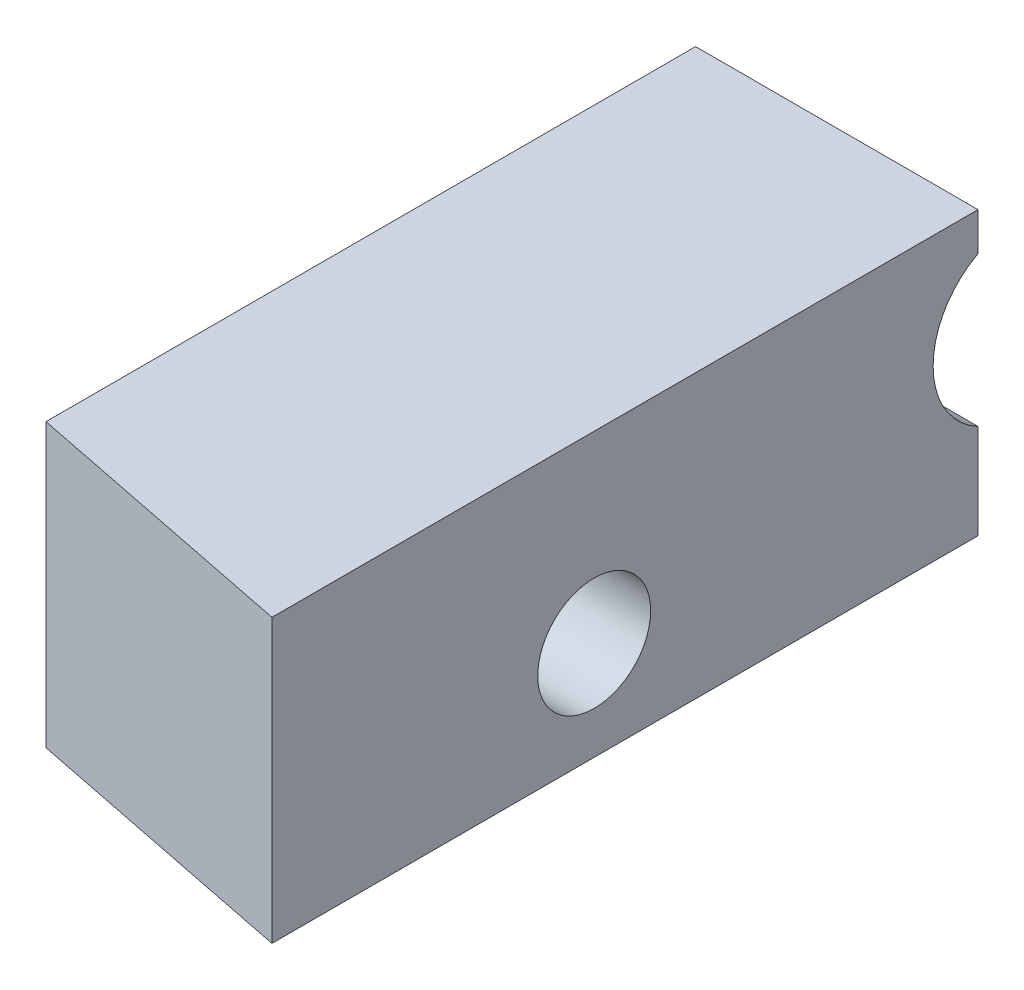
ISO-10303-21;
HEADER;
FILE_DESCRIPTION(('STEP AP214'),'2;1');
FILE_NAME('part.step','',(''),(''),'','','');
FILE_SCHEMA(('AUTOMOTIVE_DESIGN { 1 0 10303 214 1 1 1 1 }'));
ENDSEC;
DATA;
#1=APPLICATION_CONTEXT('core data for automotive mechanical design processes');
#2=APPLICATION_PROTOCOL_DEFINITION('international standard','automotive_design',2000,#1);
#3=PRODUCT_CONTEXT('',#1,'mechanical');
#4=PRODUCT('Part','Part','',(#3));
#5=PRODUCT_RELATED_PRODUCT_CATEGORY('part','',(#4));
#6=PRODUCT_DEFINITION_FORMATION('','',#4);
#7=PRODUCT_DEFINITION_CONTEXT('part definition',#1,'design');
#8=PRODUCT_DEFINITION('design','',#6,#7);
#9=PRODUCT_DEFINITION_SHAPE('','',#8);
#10=(LENGTH_UNIT() NAMED_UNIT(*) SI_UNIT(.MILLI.,.METRE.));
#11=(NAMED_UNIT(*) PLANE_ANGLE_UNIT() SI_UNIT($,.RADIAN.));
#12=(NAMED_UNIT(*) SI_UNIT($,.STERADIAN.) SOLID_ANGLE_UNIT());
#13=UNCERTAINTY_MEASURE_WITH_UNIT(LENGTH_MEASURE(1.E-05),#10,'distance_accuracy_value','');
#14=(GEOMETRIC_REPRESENTATION_CONTEXT(3) GLOBAL_UNCERTAINTY_ASSIGNED_CONTEXT((#13)) GLOBAL_UNIT_ASSIGNED_CONTEXT((#10,
#11,#12)) REPRESENTATION_CONTEXT('',''));
#15=CARTESIAN_POINT('',(0.,0.,0.));
#16=DIRECTION('',(0.,0.,1.));
#17=DIRECTION('',(1.,0.,0.));
#18=AXIS2_PLACEMENT_3D('',#15,#16,#17);
#19=CARTESIAN_POINT('',(0.,10.,0.));
#20=DIRECTION('',(0.,0.,-1.));
#21=DIRECTION('',(-1.,0.,0.));
#22=AXIS2_PLACEMENT_3D('',#19,#20,#21);
#23=PLANE('',#22);
#24=DIRECTION('',(1.,0.,0.));
#25=VECTOR('',#24,1.);
#26=CARTESIAN_POINT('',(0.,8.64763686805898,0.));
#27=LINE('',#26,#25);
#28=CARTESIAN_POINT('',(0.,8.64763686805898,0.));
#29=VERTEX_POINT('',#28);
#30=CARTESIAN_POINT('',(10.,8.64763686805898,0.));
#31=VERTEX_POINT('',#30);
#32=EDGE_CURVE('E11',#29,#31,#27,.T.);
#33=ORIENTED_EDGE('',*,*,#32,.F.);
#34=DIRECTION('',(0.,-1.,0.));
#35=VECTOR('',#34,1.);
#36=CARTESIAN_POINT('',(0.,0.,0.));
#37=LINE('',#36,#35);
#38=CARTESIAN_POINT('',(0.,10.,0.));
#39=VERTEX_POINT('',#38);
#40=EDGE_CURVE('E117',#39,#29,#37,.T.);
#41=ORIENTED_EDGE('',*,*,#40,.F.);
#42=DIRECTION('',(-1.,0.,0.));
#43=VECTOR('',#42,1.);
#44=CARTESIAN_POINT('',(0.,10.,0.));
#45=LINE('',#44,#43);
#46=CARTESIAN_POINT('',(10.,10.,0.));
#47=VERTEX_POINT('',#46);
#48=EDGE_CURVE('E108',#47,#39,#45,.T.);
#49=ORIENTED_EDGE('',*,*,#48,.F.);
#50=DIRECTION('',(0.,1.,0.));
#51=VECTOR('',#50,1.);
#52=CARTESIAN_POINT('',(10.,0.,0.));
#53=LINE('',#52,#51);
#54=EDGE_CURVE('E114',#31,#47,#53,.T.);
#55=ORIENTED_EDGE('',*,*,#54,.F.);
#56=EDGE_LOOP('',(#33,#41,#49,#55));
#57=FACE_BOUND('',#56,.T.);
#58=ADVANCED_FACE('F27',(#57),#23,.T.);
#59=CARTESIAN_POINT('',(0.,0.,25.));
#60=DIRECTION('',(1.,0.,0.));
#61=DIRECTION('',(0.,0.,-1.));
#62=AXIS2_PLACEMENT_3D('',#59,#60,#61);
#63=PLANE('',#62);
#64=CARTESIAN_POINT('',(0.,3.5,13.5893196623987));
#65=DIRECTION('',(1.,0.,0.));
#66=DIRECTION('',(0.,0.,-1.));
#67=AXIS2_PLACEMENT_3D('',#64,#65,#66);
#68=CIRCLE('',#67,2.);
#69=CARTESIAN_POINT('',(0.,3.5,11.5893196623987));
#70=VERTEX_POINT('',#69);
#71=EDGE_CURVE('E123',#70,#70,#68,.T.);
#72=ORIENTED_EDGE('',*,*,#71,.T.);
#73=EDGE_LOOP('',(#72));
#74=FACE_BOUND('',#73,.T.);
#75=DIRECTION('',(0.,0.,-1.));
#76=VECTOR('',#75,1.);
#77=CARTESIAN_POINT('',(0.,0.,25.));
#78=LINE('',#77,#76);
#79=CARTESIAN_POINT('',(0.,0.,22.9999877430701));
#80=VERTEX_POINT('',#79);
#81=CARTESIAN_POINT('',(0.,0.,0.));
#82=VERTEX_POINT('',#81);
#83=EDGE_CURVE('E88',#80,#82,#78,.T.);
#84=ORIENTED_EDGE('',*,*,#83,.F.);
#85=DIRECTION('',(0.,-1.,0.));
#86=VECTOR('',#85,1.);
#87=CARTESIAN_POINT('',(0.,10.,22.9999877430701));
#88=LINE('',#87,#86);
#89=CARTESIAN_POINT('',(0.,10.,22.9999877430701));
#90=VERTEX_POINT('',#89);
#91=EDGE_CURVE('E77',#90,#80,#88,.T.);
#92=ORIENTED_EDGE('',*,*,#91,.F.);
#93=DIRECTION('',(0.,0.,-1.));
#94=VECTOR('',#93,1.);
#95=CARTESIAN_POINT('',(0.,10.,25.));
#96=LINE('',#95,#94);
#97=EDGE_CURVE('E104',#90,#39,#96,.T.);
#98=ORIENTED_EDGE('',*,*,#97,.T.);
#99=ORIENTED_EDGE('',*,*,#40,.T.);
#100=CARTESIAN_POINT('',(0.,6.,-1.41068033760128));
#101=DIRECTION('',(1.,0.,0.));
#102=DIRECTION('',(0.,0.,1.));
#103=AXIS2_PLACEMENT_3D('',#100,#101,#102);
#104=CIRCLE('',#103,3.);
#105=CARTESIAN_POINT('',(0.,3.35236313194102,0.));
#106=VERTEX_POINT('',#105);
#107=EDGE_CURVE('E120',#29,#106,#104,.T.);
#108=ORIENTED_EDGE('',*,*,#107,.T.);
#109=EDGE_CURVE('E96',#106,#82,#37,.T.);
#110=ORIENTED_EDGE('',*,*,#109,.T.);
#111=EDGE_LOOP('',(#84,#92,#98,#99,#108,#110));
#112=FACE_BOUND('',#111,.T.);
#113=ADVANCED_FACE('F29',(#74,#112),#63,.F.);
#114=CARTESIAN_POINT('',(0.,0.,25.));
#115=DIRECTION('',(0.,1.,0.));
#116=DIRECTION('',(0.,0.,1.));
#117=AXIS2_PLACEMENT_3D('',#114,#115,#116);
#118=PLANE('',#117);
#119=DIRECTION('',(0.,0.,-1.));
#120=VECTOR('',#119,1.);
#121=CARTESIAN_POINT('',(10.,0.,25.));
#122=LINE('',#121,#120);
#123=CARTESIAN_POINT('',(10.,0.,25.));
#124=VERTEX_POINT('',#123);
#125=CARTESIAN_POINT('',(10.,0.,0.));
#126=VERTEX_POINT('',#125);
#127=EDGE_CURVE('E91',#124,#126,#122,.T.);
#128=ORIENTED_EDGE('',*,*,#127,.F.);
#129=DIRECTION('',(0.980580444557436,0.,0.196117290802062));
#130=VECTOR('',#129,1.);
#131=CARTESIAN_POINT('',(10.,0.,25.));
#132=LINE('',#131,#130);
#133=EDGE_CURVE('E49',#80,#124,#132,.T.);
#134=ORIENTED_EDGE('',*,*,#133,.F.);
#135=ORIENTED_EDGE('',*,*,#83,.T.);
#136=DIRECTION('',(1.,0.,0.));
#137=VECTOR('',#136,1.);
#138=CARTESIAN_POINT('',(0.,0.,0.));
#139=LINE('',#138,#137);
#140=EDGE_CURVE('E115',#82,#126,#139,.T.);
#141=ORIENTED_EDGE('',*,*,#140,.T.);
#142=EDGE_LOOP('',(#128,#134,#135,#141));
#143=FACE_BOUND('',#142,.T.);
#144=ADVANCED_FACE('F87',(#143),#118,.F.);
#145=CARTESIAN_POINT('',(10.,0.,25.));
#146=DIRECTION('',(-1.,0.,0.));
#147=DIRECTION('',(0.,0.,1.));
#148=AXIS2_PLACEMENT_3D('',#145,#146,#147);
#149=PLANE('',#148);
#150=CARTESIAN_POINT('',(10.,3.5,13.5893196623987));
#151=DIRECTION('',(1.,0.,0.));
#152=DIRECTION('',(0.,0.,-1.));
#153=AXIS2_PLACEMENT_3D('',#150,#151,#152);
#154=CIRCLE('',#153,2.);
#155=CARTESIAN_POINT('',(10.,3.5,11.5893196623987));
#156=VERTEX_POINT('',#155);
#157=EDGE_CURVE('E84',#156,#156,#154,.T.);
#158=ORIENTED_EDGE('',*,*,#157,.F.);
#159=EDGE_LOOP('',(#158));
#160=FACE_BOUND('',#159,.T.);
#161=CARTESIAN_POINT('',(10.,3.35236313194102,0.));
#162=VERTEX_POINT('',#161);
#163=EDGE_CURVE('E111',#126,#162,#53,.T.);
#164=ORIENTED_EDGE('',*,*,#163,.T.);
#165=CARTESIAN_POINT('',(10.,6.,-1.41068033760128));
#166=DIRECTION('',(1.,0.,0.));
#167=DIRECTION('',(0.,0.,1.));
#168=AXIS2_PLACEMENT_3D('',#165,#166,#167);
#169=CIRCLE('',#168,3.);
#170=EDGE_CURVE('E41',#31,#162,#169,.T.);
#171=ORIENTED_EDGE('',*,*,#170,.F.);
#172=ORIENTED_EDGE('',*,*,#54,.T.);
#173=DIRECTION('',(0.,0.,-1.));
#174=VECTOR('',#173,1.);
#175=CARTESIAN_POINT('',(10.,10.,25.));
#176=LINE('',#175,#174);
#177=CARTESIAN_POINT('',(10.,10.,25.));
#178=VERTEX_POINT('',#177);
#179=EDGE_CURVE('E99',#178,#47,#176,.T.);
#180=ORIENTED_EDGE('',*,*,#179,.F.);
#181=DIRECTION('',(0.,1.,0.));
#182=VECTOR('',#181,1.);
#183=CARTESIAN_POINT('',(10.,0.,25.));
#184=LINE('',#183,#182);
#185=EDGE_CURVE('E106',#124,#178,#184,.T.);
#186=ORIENTED_EDGE('',*,*,#185,.F.);
#187=ORIENTED_EDGE('',*,*,#127,.T.);
#188=EDGE_LOOP('',(#164,#171,#172,#180,#186,#187));
#189=FACE_BOUND('',#188,.T.);
#190=ADVANCED_FACE('F133',(#160,#189),#149,.F.);
#191=CARTESIAN_POINT('',(0.,10.,25.));
#192=DIRECTION('',(0.,-1.,0.));
#193=DIRECTION('',(0.,0.,-1.));
#194=AXIS2_PLACEMENT_3D('',#191,#192,#193);
#195=PLANE('',#194);
#196=ORIENTED_EDGE('',*,*,#97,.F.);
#197=DIRECTION('',(0.980580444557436,0.,0.196117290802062));
#198=VECTOR('',#197,1.);
#199=CARTESIAN_POINT('',(10.,10.,25.));
#200=LINE('',#199,#198);
#201=EDGE_CURVE('E80',#90,#178,#200,.T.);
#202=ORIENTED_EDGE('',*,*,#201,.T.);
#203=ORIENTED_EDGE('',*,*,#179,.T.);
#204=ORIENTED_EDGE('',*,*,#48,.T.);
#205=EDGE_LOOP('',(#196,#202,#203,#204));
#206=FACE_BOUND('',#205,.T.);
#207=ADVANCED_FACE('F130',(#206),#195,.F.);
#208=DIRECTION('',(1.,0.,0.));
#209=VECTOR('',#208,1.);
#210=CARTESIAN_POINT('',(0.,3.35236313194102,0.));
#211=LINE('',#210,#209);
#212=EDGE_CURVE('E35',#162,#106,#211,.F.);
#213=ORIENTED_EDGE('',*,*,#212,.F.);
#214=ORIENTED_EDGE('',*,*,#163,.F.);
#215=ORIENTED_EDGE('',*,*,#140,.F.);
#216=ORIENTED_EDGE('',*,*,#109,.F.);
#217=EDGE_LOOP('',(#213,#214,#215,#216));
#218=FACE_BOUND('',#217,.T.);
#219=ADVANCED_FACE('F139',(#218),#23,.T.);
#220=CARTESIAN_POINT('',(0.,6.,-1.41068033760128));
#221=DIRECTION('',(1.,0.,0.));
#222=DIRECTION('',(0.,0.,-1.));
#223=AXIS2_PLACEMENT_3D('',#220,#221,#222);
#224=CYLINDRICAL_SURFACE('',#223,3.);
#225=ORIENTED_EDGE('',*,*,#32,.T.);
#226=ORIENTED_EDGE('',*,*,#170,.T.);
#227=ORIENTED_EDGE('',*,*,#212,.T.);
#228=ORIENTED_EDGE('',*,*,#107,.F.);
#229=EDGE_LOOP('',(#225,#226,#227,#228));
#230=FACE_BOUND('',#229,.T.);
#231=ADVANCED_FACE('F141',(#230),#224,.F.);
#232=CARTESIAN_POINT('',(0.,3.5,13.5893196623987));
#233=DIRECTION('',(1.,0.,0.));
#234=DIRECTION('',(0.,0.,-1.));
#235=AXIS2_PLACEMENT_3D('',#232,#233,#234);
#236=CYLINDRICAL_SURFACE('',#235,2.);
#237=ORIENTED_EDGE('',*,*,#71,.F.);
#238=EDGE_LOOP('',(#237));
#239=FACE_BOUND('',#238,.T.);
#240=ORIENTED_EDGE('',*,*,#157,.T.);
#241=EDGE_LOOP('',(#240));
#242=FACE_BOUND('',#241,.T.);
#243=ADVANCED_FACE('F143',(#239,#242),#236,.F.);
#244=CARTESIAN_POINT('',(10.,10.,25.));
#245=DIRECTION('',(0.196117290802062,0.,-0.980580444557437));
#246=DIRECTION('',(-0.980580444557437,0.,-0.196117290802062));
#247=AXIS2_PLACEMENT_3D('',#244,#245,#246);
#248=PLANE('',#247);
#249=ORIENTED_EDGE('',*,*,#133,.T.);
#250=ORIENTED_EDGE('',*,*,#185,.T.);
#251=ORIENTED_EDGE('',*,*,#201,.F.);
#252=ORIENTED_EDGE('',*,*,#91,.T.);
#253=EDGE_LOOP('',(#249,#250,#251,#252));
#254=FACE_BOUND('',#253,.T.);
#255=ADVANCED_FACE('F78',(#254),#248,.F.);
#256=CLOSED_SHELL('',(#58,#113,#144,#190,#207,#219,#231,#243,#255));
#257=MANIFOLD_SOLID_BREP('B2',#256);
#258=ADVANCED_BREP_SHAPE_REPRESENTATION('',(#18,#257),#14);
#259=SHAPE_DEFINITION_REPRESENTATION(#9,#258);
ENDSEC;
END-ISO-10303-21;
